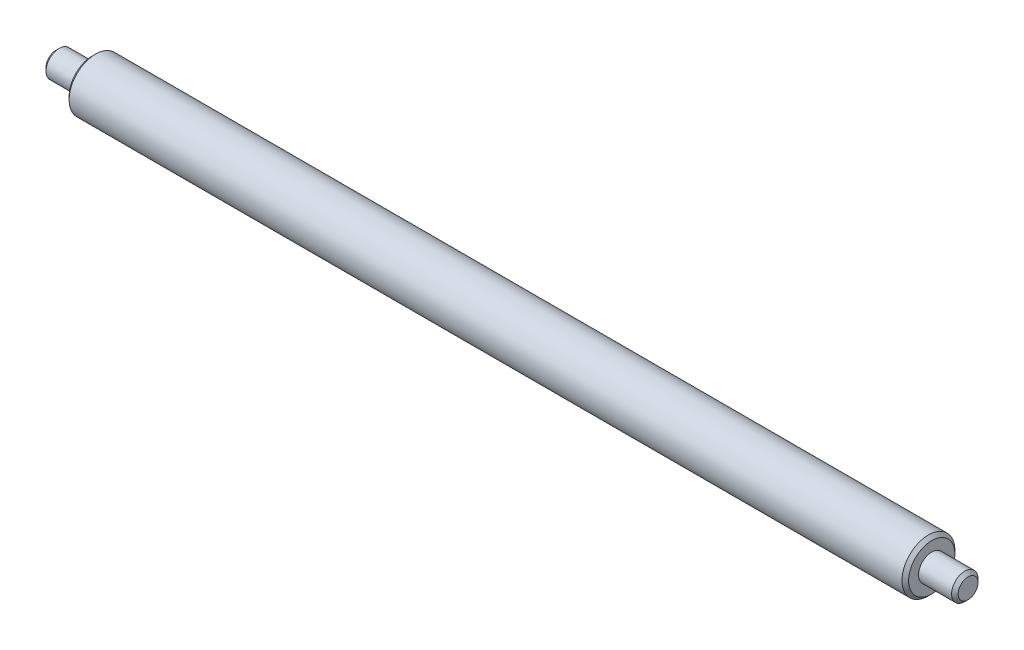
ISO-10303-21;
HEADER;
FILE_DESCRIPTION(('STEP AP214'),'2;1');
FILE_NAME('part.step','',(''),(''),'','','');
FILE_SCHEMA(('AUTOMOTIVE_DESIGN { 1 0 10303 214 1 1 1 1 }'));
ENDSEC;
DATA;
#1=APPLICATION_CONTEXT('core data for automotive mechanical design processes');
#2=APPLICATION_PROTOCOL_DEFINITION('international standard','automotive_design',2000,#1);
#3=PRODUCT_CONTEXT('',#1,'mechanical');
#4=PRODUCT('Part','Part','',(#3));
#5=PRODUCT_RELATED_PRODUCT_CATEGORY('part','',(#4));
#6=PRODUCT_DEFINITION_FORMATION('','',#4);
#7=PRODUCT_DEFINITION_CONTEXT('part definition',#1,'design');
#8=PRODUCT_DEFINITION('design','',#6,#7);
#9=PRODUCT_DEFINITION_SHAPE('','',#8);
#10=(LENGTH_UNIT() NAMED_UNIT(*) SI_UNIT(.MILLI.,.METRE.));
#11=(NAMED_UNIT(*) PLANE_ANGLE_UNIT() SI_UNIT($,.RADIAN.));
#12=(NAMED_UNIT(*) SI_UNIT($,.STERADIAN.) SOLID_ANGLE_UNIT());
#13=UNCERTAINTY_MEASURE_WITH_UNIT(LENGTH_MEASURE(1.E-05),#10,'distance_accuracy_value','');
#14=(GEOMETRIC_REPRESENTATION_CONTEXT(3) GLOBAL_UNCERTAINTY_ASSIGNED_CONTEXT((#13)) GLOBAL_UNIT_ASSIGNED_CONTEXT((#10,
#11,#12)) REPRESENTATION_CONTEXT('',''));
#15=CARTESIAN_POINT('',(0.,0.,0.));
#16=DIRECTION('',(0.,0.,1.));
#17=DIRECTION('',(1.,0.,0.));
#18=AXIS2_PLACEMENT_3D('',#15,#16,#17);
#19=CARTESIAN_POINT('',(138.,0.,0.));
#20=DIRECTION('',(-1.,0.,0.));
#21=DIRECTION('',(0.,0.,1.));
#22=AXIS2_PLACEMENT_3D('',#19,#20,#21);
#23=PLANE('',#22);
#24=CARTESIAN_POINT('',(138.,0.,0.));
#25=DIRECTION('',(-1.,0.,0.));
#26=DIRECTION('',(0.,0.,1.));
#27=AXIS2_PLACEMENT_3D('',#24,#25,#26);
#28=CIRCLE('',#27,3.);
#29=CARTESIAN_POINT('',(138.,0.,3.));
#30=VERTEX_POINT('',#29);
#31=EDGE_CURVE('E67',#30,#30,#28,.T.);
#32=ORIENTED_EDGE('',*,*,#31,.F.);
#33=EDGE_LOOP('',(#32));
#34=FACE_BOUND('',#33,.T.);
#35=ADVANCED_FACE('F33',(#34),#23,.F.);
#36=CARTESIAN_POINT('',(-138.,0.,0.));
#37=DIRECTION('',(1.,0.,0.));
#38=DIRECTION('',(0.,0.,-1.));
#39=AXIS2_PLACEMENT_3D('',#36,#37,#38);
#40=PLANE('',#39);
#41=CARTESIAN_POINT('',(-138.,0.,0.));
#42=DIRECTION('',(-1.,0.,0.));
#43=DIRECTION('',(0.,0.,1.));
#44=AXIS2_PLACEMENT_3D('',#41,#42,#43);
#45=CIRCLE('',#44,3.);
#46=CARTESIAN_POINT('',(-138.,0.,3.));
#47=VERTEX_POINT('',#46);
#48=EDGE_CURVE('E10',#47,#47,#45,.T.);
#49=ORIENTED_EDGE('',*,*,#48,.T.);
#50=EDGE_LOOP('',(#49));
#51=FACE_BOUND('',#50,.T.);
#52=ADVANCED_FACE('F74',(#51),#40,.F.);
#53=CARTESIAN_POINT('',(-137.,0.,0.));
#54=DIRECTION('',(1.,0.,0.));
#55=DIRECTION('',(0.,0.,-1.));
#56=AXIS2_PLACEMENT_3D('',#53,#54,#55);
#57=CONICAL_SURFACE('',#56,4.,0.785398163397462);
#58=ORIENTED_EDGE('',*,*,#48,.F.);
#59=EDGE_LOOP('',(#58));
#60=FACE_BOUND('',#59,.T.);
#61=CARTESIAN_POINT('',(-137.,0.,0.));
#62=DIRECTION('',(-1.,0.,0.));
#63=DIRECTION('',(0.,0.,1.));
#64=AXIS2_PLACEMENT_3D('',#61,#62,#63);
#65=CIRCLE('',#64,4.);
#66=CARTESIAN_POINT('',(-137.,0.,4.));
#67=VERTEX_POINT('',#66);
#68=EDGE_CURVE('E39',#67,#67,#65,.T.);
#69=ORIENTED_EDGE('',*,*,#68,.T.);
#70=EDGE_LOOP('',(#69));
#71=FACE_BOUND('',#70,.T.);
#72=ADVANCED_FACE('F78',(#60,#71),#57,.T.);
#73=CARTESIAN_POINT('',(-138.,0.,0.));
#74=DIRECTION('',(-1.,0.,0.));
#75=DIRECTION('',(0.,0.,1.));
#76=AXIS2_PLACEMENT_3D('',#73,#74,#75);
#77=CYLINDRICAL_SURFACE('',#76,4.);
#78=ORIENTED_EDGE('',*,*,#68,.F.);
#79=EDGE_LOOP('',(#78));
#80=FACE_BOUND('',#79,.T.);
#81=CARTESIAN_POINT('',(-127.,0.,0.));
#82=DIRECTION('',(-1.,0.,0.));
#83=DIRECTION('',(0.,0.,1.));
#84=AXIS2_PLACEMENT_3D('',#81,#82,#83);
#85=CIRCLE('',#84,4.);
#86=CARTESIAN_POINT('',(-127.,0.,4.));
#87=VERTEX_POINT('',#86);
#88=EDGE_CURVE('E43',#87,#87,#85,.T.);
#89=ORIENTED_EDGE('',*,*,#88,.T.);
#90=EDGE_LOOP('',(#89));
#91=FACE_BOUND('',#90,.T.);
#92=ADVANCED_FACE('F82',(#80,#91),#77,.T.);
#93=CARTESIAN_POINT('',(-127.,4.,0.));
#94=DIRECTION('',(1.,0.,0.));
#95=DIRECTION('',(0.,0.,-1.));
#96=AXIS2_PLACEMENT_3D('',#93,#94,#95);
#97=PLANE('',#96);
#98=ORIENTED_EDGE('',*,*,#88,.F.);
#99=EDGE_LOOP('',(#98));
#100=FACE_BOUND('',#99,.T.);
#101=CARTESIAN_POINT('',(-127.,0.,0.));
#102=DIRECTION('',(-1.,0.,0.));
#103=DIRECTION('',(0.,0.,1.));
#104=AXIS2_PLACEMENT_3D('',#101,#102,#103);
#105=CIRCLE('',#104,7.);
#106=CARTESIAN_POINT('',(-127.,0.,7.));
#107=VERTEX_POINT('',#106);
#108=EDGE_CURVE('E47',#107,#107,#105,.T.);
#109=ORIENTED_EDGE('',*,*,#108,.T.);
#110=EDGE_LOOP('',(#109));
#111=FACE_BOUND('',#110,.T.);
#112=ADVANCED_FACE('F88',(#100,#111),#97,.F.);
#113=CARTESIAN_POINT('',(-126.,0.,0.));
#114=DIRECTION('',(1.,0.,0.));
#115=DIRECTION('',(0.,0.,-1.));
#116=AXIS2_PLACEMENT_3D('',#113,#114,#115);
#117=CONICAL_SURFACE('',#116,8.,0.785398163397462);
#118=ORIENTED_EDGE('',*,*,#108,.F.);
#119=EDGE_LOOP('',(#118));
#120=FACE_BOUND('',#119,.T.);
#121=CARTESIAN_POINT('',(-126.,0.,0.));
#122=DIRECTION('',(-1.,0.,0.));
#123=DIRECTION('',(0.,0.,1.));
#124=AXIS2_PLACEMENT_3D('',#121,#122,#123);
#125=CIRCLE('',#124,8.);
#126=CARTESIAN_POINT('',(-126.,0.,8.));
#127=VERTEX_POINT('',#126);
#128=EDGE_CURVE('E52',#127,#127,#125,.T.);
#129=ORIENTED_EDGE('',*,*,#128,.T.);
#130=EDGE_LOOP('',(#129));
#131=FACE_BOUND('',#130,.T.);
#132=ADVANCED_FACE('F92',(#120,#131),#117,.T.);
#133=CARTESIAN_POINT('',(-138.,0.,0.));
#134=DIRECTION('',(-1.,0.,0.));
#135=DIRECTION('',(0.,0.,1.));
#136=AXIS2_PLACEMENT_3D('',#133,#134,#135);
#137=CYLINDRICAL_SURFACE('',#136,8.);
#138=ORIENTED_EDGE('',*,*,#128,.F.);
#139=EDGE_LOOP('',(#138));
#140=FACE_BOUND('',#139,.T.);
#141=CARTESIAN_POINT('',(126.,0.,0.));
#142=DIRECTION('',(-1.,0.,0.));
#143=DIRECTION('',(0.,0.,1.));
#144=AXIS2_PLACEMENT_3D('',#141,#142,#143);
#145=CIRCLE('',#144,8.);
#146=CARTESIAN_POINT('',(126.,0.,8.));
#147=VERTEX_POINT('',#146);
#148=EDGE_CURVE('E55',#147,#147,#145,.T.);
#149=ORIENTED_EDGE('',*,*,#148,.T.);
#150=EDGE_LOOP('',(#149));
#151=FACE_BOUND('',#150,.T.);
#152=ADVANCED_FACE('F96',(#140,#151),#137,.T.);
#153=CARTESIAN_POINT('',(127.,0.,0.));
#154=DIRECTION('',(-1.,0.,0.));
#155=DIRECTION('',(0.,0.,1.));
#156=AXIS2_PLACEMENT_3D('',#153,#154,#155);
#157=CONICAL_SURFACE('',#156,7.,0.785398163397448);
#158=ORIENTED_EDGE('',*,*,#148,.F.);
#159=EDGE_LOOP('',(#158));
#160=FACE_BOUND('',#159,.T.);
#161=CARTESIAN_POINT('',(127.,0.,0.));
#162=DIRECTION('',(-1.,0.,0.));
#163=DIRECTION('',(0.,0.,1.));
#164=AXIS2_PLACEMENT_3D('',#161,#162,#163);
#165=CIRCLE('',#164,7.);
#166=CARTESIAN_POINT('',(127.,0.,7.));
#167=VERTEX_POINT('',#166);
#168=EDGE_CURVE('E58',#167,#167,#165,.T.);
#169=ORIENTED_EDGE('',*,*,#168,.T.);
#170=EDGE_LOOP('',(#169));
#171=FACE_BOUND('',#170,.T.);
#172=ADVANCED_FACE('F100',(#160,#171),#157,.T.);
#173=CARTESIAN_POINT('',(127.,4.,0.));
#174=DIRECTION('',(-1.,0.,0.));
#175=DIRECTION('',(0.,0.,1.));
#176=AXIS2_PLACEMENT_3D('',#173,#174,#175);
#177=PLANE('',#176);
#178=ORIENTED_EDGE('',*,*,#168,.F.);
#179=EDGE_LOOP('',(#178));
#180=FACE_BOUND('',#179,.T.);
#181=CARTESIAN_POINT('',(127.,0.,0.));
#182=DIRECTION('',(-1.,0.,0.));
#183=DIRECTION('',(0.,0.,1.));
#184=AXIS2_PLACEMENT_3D('',#181,#182,#183);
#185=CIRCLE('',#184,4.);
#186=CARTESIAN_POINT('',(127.,0.,4.));
#187=VERTEX_POINT('',#186);
#188=EDGE_CURVE('E61',#187,#187,#185,.T.);
#189=ORIENTED_EDGE('',*,*,#188,.T.);
#190=EDGE_LOOP('',(#189));
#191=FACE_BOUND('',#190,.T.);
#192=ADVANCED_FACE('F104',(#180,#191),#177,.F.);
#193=CARTESIAN_POINT('',(-138.,0.,0.));
#194=DIRECTION('',(-1.,0.,0.));
#195=DIRECTION('',(0.,0.,1.));
#196=AXIS2_PLACEMENT_3D('',#193,#194,#195);
#197=CYLINDRICAL_SURFACE('',#196,4.);
#198=ORIENTED_EDGE('',*,*,#188,.F.);
#199=EDGE_LOOP('',(#198));
#200=FACE_BOUND('',#199,.T.);
#201=CARTESIAN_POINT('',(137.,0.,0.));
#202=DIRECTION('',(-1.,0.,0.));
#203=DIRECTION('',(0.,0.,1.));
#204=AXIS2_PLACEMENT_3D('',#201,#202,#203);
#205=CIRCLE('',#204,4.);
#206=CARTESIAN_POINT('',(137.,0.,4.));
#207=VERTEX_POINT('',#206);
#208=EDGE_CURVE('E64',#207,#207,#205,.T.);
#209=ORIENTED_EDGE('',*,*,#208,.T.);
#210=EDGE_LOOP('',(#209));
#211=FACE_BOUND('',#210,.T.);
#212=ADVANCED_FACE('F108',(#200,#211),#197,.T.);
#213=CARTESIAN_POINT('',(138.,0.,0.));
#214=DIRECTION('',(-1.,0.,0.));
#215=DIRECTION('',(0.,0.,1.));
#216=AXIS2_PLACEMENT_3D('',#213,#214,#215);
#217=CONICAL_SURFACE('',#216,3.,0.785398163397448);
#218=ORIENTED_EDGE('',*,*,#208,.F.);
#219=EDGE_LOOP('',(#218));
#220=FACE_BOUND('',#219,.T.);
#221=ORIENTED_EDGE('',*,*,#31,.T.);
#222=EDGE_LOOP('',(#221));
#223=FACE_BOUND('',#222,.T.);
#224=ADVANCED_FACE('F71',(#220,#223),#217,.T.);
#225=CLOSED_SHELL('',(#35,#52,#72,#92,#112,#132,#152,#172,#192,#212,#224));
#226=MANIFOLD_SOLID_BREP('B2',#225);
#227=ADVANCED_BREP_SHAPE_REPRESENTATION('',(#18,#226),#14);
#228=SHAPE_DEFINITION_REPRESENTATION(#9,#227);
ENDSEC;
END-ISO-10303-21;
